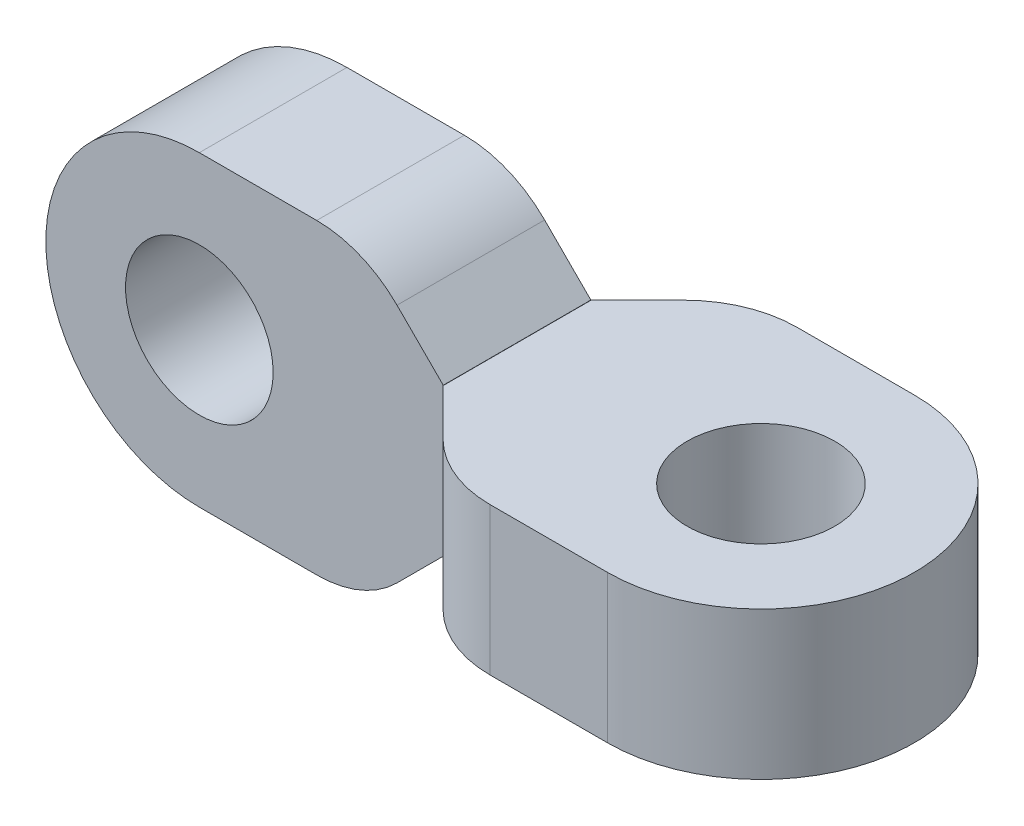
ISO-10303-21;
HEADER;
FILE_DESCRIPTION(('STEP AP214'),'2;1');
FILE_NAME('part.step','',(''),(''),'','','');
FILE_SCHEMA(('AUTOMOTIVE_DESIGN { 1 0 10303 214 1 1 1 1 }'));
ENDSEC;
DATA;
#1=APPLICATION_CONTEXT('core data for automotive mechanical design processes');
#2=APPLICATION_PROTOCOL_DEFINITION('international standard','automotive_design',2000,#1);
#3=PRODUCT_CONTEXT('',#1,'mechanical');
#4=PRODUCT('Part','Part','',(#3));
#5=PRODUCT_RELATED_PRODUCT_CATEGORY('part','',(#4));
#6=PRODUCT_DEFINITION_FORMATION('','',#4);
#7=PRODUCT_DEFINITION_CONTEXT('part definition',#1,'design');
#8=PRODUCT_DEFINITION('design','',#6,#7);
#9=PRODUCT_DEFINITION_SHAPE('','',#8);
#10=(LENGTH_UNIT() NAMED_UNIT(*) SI_UNIT(.MILLI.,.METRE.));
#11=(NAMED_UNIT(*) PLANE_ANGLE_UNIT() SI_UNIT($,.RADIAN.));
#12=(NAMED_UNIT(*) SI_UNIT($,.STERADIAN.) SOLID_ANGLE_UNIT());
#13=UNCERTAINTY_MEASURE_WITH_UNIT(LENGTH_MEASURE(1.E-05),#10,'distance_accuracy_value','');
#14=(GEOMETRIC_REPRESENTATION_CONTEXT(3) GLOBAL_UNCERTAINTY_ASSIGNED_CONTEXT((#13)) GLOBAL_UNIT_ASSIGNED_CONTEXT((#10,
#11,#12)) REPRESENTATION_CONTEXT('',''));
#15=CARTESIAN_POINT('',(0.,0.,0.));
#16=DIRECTION('',(0.,0.,1.));
#17=DIRECTION('',(1.,0.,0.));
#18=AXIS2_PLACEMENT_3D('',#15,#16,#17);
#19=CARTESIAN_POINT('',(13.6398,-8.58519999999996,4.12750000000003));
#20=DIRECTION('',(-1.,0.,0.));
#21=DIRECTION('',(0.,0.,1.));
#22=AXIS2_PLACEMENT_3D('',#19,#20,#21);
#23=PLANE('',#22);
#24=DIRECTION('',(0.,1.,0.));
#25=VECTOR('',#24,1.);
#26=CARTESIAN_POINT('',(13.6398,-8.58519999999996,4.12750000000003));
#27=LINE('',#26,#25);
#28=CARTESIAN_POINT('',(13.6397999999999,-4.14020000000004,4.12750000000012));
#29=VERTEX_POINT('',#28);
#30=CARTESIAN_POINT('',(13.6397999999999,-4.12750000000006,4.12750000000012));
#31=VERTEX_POINT('',#30);
#32=EDGE_CURVE('E235',#29,#31,#27,.T.);
#33=ORIENTED_EDGE('',*,*,#32,.F.);
#34=DIRECTION('',(0.,0.,-1.));
#35=VECTOR('',#34,1.);
#36=CARTESIAN_POINT('',(13.6397999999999,-4.14020000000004,4.12750000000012));
#37=LINE('',#36,#35);
#38=CARTESIAN_POINT('',(13.6398,-4.14020000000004,-4.12750000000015));
#39=VERTEX_POINT('',#38);
#40=EDGE_CURVE('E272',#29,#39,#37,.T.);
#41=ORIENTED_EDGE('',*,*,#40,.T.);
#42=DIRECTION('',(0.,1.,0.));
#43=VECTOR('',#42,1.);
#44=CARTESIAN_POINT('',(13.6398000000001,-8.58519999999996,-4.12749999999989));
#45=LINE('',#44,#43);
#46=CARTESIAN_POINT('',(13.6398,-4.12750000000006,-4.12750000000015));
#47=VERTEX_POINT('',#46);
#48=EDGE_CURVE('E224',#39,#47,#45,.T.);
#49=ORIENTED_EDGE('',*,*,#48,.T.);
#50=DIRECTION('',(0.,0.,-1.));
#51=VECTOR('',#50,1.);
#52=CARTESIAN_POINT('',(13.6398,-4.12749999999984,8.58519999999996));
#53=LINE('',#52,#51);
#54=EDGE_CURVE('E209',#31,#47,#53,.T.);
#55=ORIENTED_EDGE('',*,*,#54,.F.);
#56=EDGE_LOOP('',(#33,#41,#49,#55));
#57=FACE_BOUND('',#56,.T.);
#58=ADVANCED_FACE('F36',(#57),#23,.F.);
#59=CARTESIAN_POINT('',(-1.11022302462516E-13,0.,4.12750000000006));
#60=DIRECTION('',(0.,0.,1.));
#61=DIRECTION('',(1.,0.,0.));
#62=AXIS2_PLACEMENT_3D('',#59,#60,#61);
#63=PLANE('',#62);
#64=DIRECTION('',(0.707106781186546,-0.707106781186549,0.));
#65=VECTOR('',#64,1.);
#66=CARTESIAN_POINT('',(8.89000000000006,8.88999999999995,4.12750000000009));
#67=LINE('',#66,#65);
#68=CARTESIAN_POINT('',(13.6398,4.14019999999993,4.12750000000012));
#69=VERTEX_POINT('',#68);
#70=CARTESIAN_POINT('',(11.0546719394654,6.72532806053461,4.12749999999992));
#71=VERTEX_POINT('',#70);
#72=EDGE_CURVE('E267',#69,#71,#67,.F.);
#73=ORIENTED_EDGE('',*,*,#72,.T.);
#74=CARTESIAN_POINT('',(6.56454387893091,2.23519999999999,4.12750000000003));
#75=DIRECTION('',(0.,0.,1.));
#76=DIRECTION('',(1.,0.,0.));
#77=AXIS2_PLACEMENT_3D('',#74,#75,#76);
#78=CIRCLE('',#77,6.35);
#79=CARTESIAN_POINT('',(6.56454387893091,8.58519999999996,4.12750000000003));
#80=VERTEX_POINT('',#79);
#81=EDGE_CURVE('E296',#71,#80,#78,.T.);
#82=ORIENTED_EDGE('',*,*,#81,.T.);
#83=DIRECTION('',(-1.,0.,0.));
#84=VECTOR('',#83,1.);
#85=CARTESIAN_POINT('',(13.6398,8.58519999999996,4.12750000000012));
#86=LINE('',#85,#84);
#87=CARTESIAN_POINT('',(-1.11022302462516E-13,8.58519999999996,4.12750000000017));
#88=VERTEX_POINT('',#87);
#89=EDGE_CURVE('E237',#80,#88,#86,.T.);
#90=ORIENTED_EDGE('',*,*,#89,.T.);
#91=CARTESIAN_POINT('',(-1.11022302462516E-13,0.,4.12750000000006));
#92=DIRECTION('',(0.,0.,1.));
#93=DIRECTION('',(1.,0.,0.));
#94=AXIS2_PLACEMENT_3D('',#91,#92,#93);
#95=CIRCLE('',#94,8.58519999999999);
#96=CARTESIAN_POINT('',(0.,-8.58519999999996,4.12750000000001));
#97=VERTEX_POINT('',#96);
#98=EDGE_CURVE('E229',#88,#97,#95,.T.);
#99=ORIENTED_EDGE('',*,*,#98,.T.);
#100=DIRECTION('',(1.,0.,0.));
#101=VECTOR('',#100,1.);
#102=CARTESIAN_POINT('',(0.,-8.58519999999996,4.12750000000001));
#103=LINE('',#102,#101);
#104=CARTESIAN_POINT('',(6.56454387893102,-8.58519999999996,4.12749999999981));
#105=VERTEX_POINT('',#104);
#106=EDGE_CURVE('E232',#97,#105,#103,.T.);
#107=ORIENTED_EDGE('',*,*,#106,.T.);
#108=CARTESIAN_POINT('',(6.5645438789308,-2.23519999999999,4.12749999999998));
#109=DIRECTION('',(0.,0.,1.));
#110=DIRECTION('',(1.,0.,0.));
#111=AXIS2_PLACEMENT_3D('',#108,#109,#110);
#112=CIRCLE('',#111,6.35);
#113=CARTESIAN_POINT('',(11.0546719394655,-6.72532806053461,4.12749999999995));
#114=VERTEX_POINT('',#113);
#115=EDGE_CURVE('E51',#105,#114,#112,.T.);
#116=ORIENTED_EDGE('',*,*,#115,.T.);
#117=DIRECTION('',(-0.707106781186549,-0.707106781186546,0.));
#118=VECTOR('',#117,1.);
#119=CARTESIAN_POINT('',(8.88999999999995,-8.88999999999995,4.12749999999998));
#120=LINE('',#119,#118);
#121=EDGE_CURVE('E265',#114,#29,#120,.F.);
#122=ORIENTED_EDGE('',*,*,#121,.T.);
#123=ORIENTED_EDGE('',*,*,#32,.T.);
#124=CARTESIAN_POINT('',(13.6398,4.12749999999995,4.12750000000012));
#125=VERTEX_POINT('',#124);
#126=EDGE_CURVE('E238',#31,#125,#27,.T.);
#127=ORIENTED_EDGE('',*,*,#126,.T.);
#128=EDGE_CURVE('E234',#125,#69,#27,.T.);
#129=ORIENTED_EDGE('',*,*,#128,.T.);
#130=EDGE_LOOP('',(#73,#82,#90,#99,#107,#116,#122,#123,#127,#129));
#131=FACE_BOUND('',#130,.T.);
#132=CARTESIAN_POINT('',(-1.11022302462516E-13,0.,4.12750000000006));
#133=DIRECTION('',(0.,0.,1.));
#134=DIRECTION('',(1.,0.,0.));
#135=AXIS2_PLACEMENT_3D('',#132,#133,#134);
#136=CIRCLE('',#135,4.1275);
#137=CARTESIAN_POINT('',(4.12749999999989,0.,4.12750000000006));
#138=VERTEX_POINT('',#137);
#139=EDGE_CURVE('E214',#138,#138,#136,.T.);
#140=ORIENTED_EDGE('',*,*,#139,.F.);
#141=EDGE_LOOP('',(#140));
#142=FACE_BOUND('',#141,.T.);
#143=ADVANCED_FACE('F305',(#131,#142),#63,.T.);
#144=CARTESIAN_POINT('',(0.,0.,-4.12750000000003));
#145=DIRECTION('',(0.,0.,1.));
#146=DIRECTION('',(1.,0.,0.));
#147=AXIS2_PLACEMENT_3D('',#144,#145,#146);
#148=PLANE('',#147);
#149=DIRECTION('',(-1.,0.,0.));
#150=VECTOR('',#149,1.);
#151=CARTESIAN_POINT('',(13.6398,8.58519999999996,-4.12750000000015));
#152=LINE('',#151,#150);
#153=CARTESIAN_POINT('',(6.56454387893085,8.58519999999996,-4.12749999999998));
#154=VERTEX_POINT('',#153);
#155=CARTESIAN_POINT('',(0.,8.58519999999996,-4.12749999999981));
#156=VERTEX_POINT('',#155);
#157=EDGE_CURVE('E226',#154,#156,#152,.T.);
#158=ORIENTED_EDGE('',*,*,#157,.F.);
#159=CARTESIAN_POINT('',(6.56454387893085,2.23519999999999,-4.12749999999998));
#160=DIRECTION('',(0.,0.,1.));
#161=DIRECTION('',(1.,0.,0.));
#162=AXIS2_PLACEMENT_3D('',#159,#160,#161);
#163=CIRCLE('',#162,6.35);
#164=CARTESIAN_POINT('',(11.0546719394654,6.72532806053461,-4.12749999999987));
#165=VERTEX_POINT('',#164);
#166=EDGE_CURVE('E291',#154,#165,#163,.F.);
#167=ORIENTED_EDGE('',*,*,#166,.T.);
#168=DIRECTION('',(-0.707106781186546,0.707106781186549,0.));
#169=VECTOR('',#168,1.);
#170=CARTESIAN_POINT('',(9.19480000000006,8.58519999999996,-4.12750000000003));
#171=LINE('',#170,#169);
#172=CARTESIAN_POINT('',(13.6398,4.14019999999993,-4.12750000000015));
#173=VERTEX_POINT('',#172);
#174=EDGE_CURVE('E261',#165,#173,#171,.F.);
#175=ORIENTED_EDGE('',*,*,#174,.T.);
#176=CARTESIAN_POINT('',(13.6398,4.12749999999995,-4.12750000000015));
#177=VERTEX_POINT('',#176);
#178=EDGE_CURVE('E223',#177,#173,#45,.T.);
#179=ORIENTED_EDGE('',*,*,#178,.F.);
#180=EDGE_CURVE('E227',#47,#177,#45,.T.);
#181=ORIENTED_EDGE('',*,*,#180,.F.);
#182=ORIENTED_EDGE('',*,*,#48,.F.);
#183=DIRECTION('',(0.707106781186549,0.707106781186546,0.));
#184=VECTOR('',#183,1.);
#185=CARTESIAN_POINT('',(13.6398,-4.14020000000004,-4.12750000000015));
#186=LINE('',#185,#184);
#187=CARTESIAN_POINT('',(11.0546719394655,-6.72532806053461,-4.12749999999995));
#188=VERTEX_POINT('',#187);
#189=EDGE_CURVE('E258',#39,#188,#186,.F.);
#190=ORIENTED_EDGE('',*,*,#189,.T.);
#191=CARTESIAN_POINT('',(6.56454387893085,-2.23519999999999,-4.12749999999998));
#192=DIRECTION('',(0.,0.,1.));
#193=DIRECTION('',(1.,0.,0.));
#194=AXIS2_PLACEMENT_3D('',#191,#192,#193);
#195=CIRCLE('',#194,6.35);
#196=CARTESIAN_POINT('',(6.56454387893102,-8.58519999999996,-4.12750000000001));
#197=VERTEX_POINT('',#196);
#198=EDGE_CURVE('E289',#188,#197,#195,.F.);
#199=ORIENTED_EDGE('',*,*,#198,.T.);
#200=DIRECTION('',(1.,0.,0.));
#201=VECTOR('',#200,1.);
#202=CARTESIAN_POINT('',(2.22044604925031E-13,-8.58519999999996,-4.12750000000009));
#203=LINE('',#202,#201);
#204=CARTESIAN_POINT('',(2.22044604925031E-13,-8.58519999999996,-4.12750000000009));
#205=VERTEX_POINT('',#204);
#206=EDGE_CURVE('E220',#205,#197,#203,.T.);
#207=ORIENTED_EDGE('',*,*,#206,.F.);
#208=CARTESIAN_POINT('',(0.,0.,-4.12750000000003));
#209=DIRECTION('',(0.,0.,1.));
#210=DIRECTION('',(1.,0.,0.));
#211=AXIS2_PLACEMENT_3D('',#208,#209,#210);
#212=CIRCLE('',#211,8.58519999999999);
#213=EDGE_CURVE('E217',#156,#205,#212,.T.);
#214=ORIENTED_EDGE('',*,*,#213,.F.);
#215=EDGE_LOOP('',(#158,#167,#175,#179,#181,#182,#190,#199,#207,#214));
#216=FACE_BOUND('',#215,.T.);
#217=CARTESIAN_POINT('',(0.,0.,-4.12750000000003));
#218=DIRECTION('',(0.,0.,1.));
#219=DIRECTION('',(1.,0.,0.));
#220=AXIS2_PLACEMENT_3D('',#217,#218,#219);
#221=CIRCLE('',#220,4.1275);
#222=CARTESIAN_POINT('',(4.1275,0.,-4.12750000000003));
#223=VERTEX_POINT('',#222);
#224=EDGE_CURVE('E183',#223,#223,#221,.T.);
#225=ORIENTED_EDGE('',*,*,#224,.T.);
#226=EDGE_LOOP('',(#225));
#227=FACE_BOUND('',#226,.T.);
#228=ADVANCED_FACE('F315',(#216,#227),#148,.F.);
#229=CARTESIAN_POINT('',(-1.11022302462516E-13,0.,4.12750000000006));
#230=DIRECTION('',(0.,0.,-1.));
#231=DIRECTION('',(-1.,0.,0.));
#232=AXIS2_PLACEMENT_3D('',#229,#230,#231);
#233=CYLINDRICAL_SURFACE('',#232,8.58519999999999);
#234=ORIENTED_EDGE('',*,*,#213,.T.);
#235=DIRECTION('',(0.,0.,-1.));
#236=VECTOR('',#235,1.);
#237=CARTESIAN_POINT('',(0.,-8.58519999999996,4.12750000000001));
#238=LINE('',#237,#236);
#239=EDGE_CURVE('E243',#97,#205,#238,.T.);
#240=ORIENTED_EDGE('',*,*,#239,.F.);
#241=ORIENTED_EDGE('',*,*,#98,.F.);
#242=DIRECTION('',(0.,0.,-1.));
#243=VECTOR('',#242,1.);
#244=CARTESIAN_POINT('',(-1.11022302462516E-13,8.58519999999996,4.12750000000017));
#245=LINE('',#244,#243);
#246=EDGE_CURVE('E240',#88,#156,#245,.T.);
#247=ORIENTED_EDGE('',*,*,#246,.T.);
#248=EDGE_LOOP('',(#234,#240,#241,#247));
#249=FACE_BOUND('',#248,.T.);
#250=ADVANCED_FACE('F38',(#249),#233,.T.);
#251=CARTESIAN_POINT('',(0.,-8.58519999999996,4.12750000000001));
#252=DIRECTION('',(0.,1.,0.));
#253=DIRECTION('',(0.,0.,1.));
#254=AXIS2_PLACEMENT_3D('',#251,#252,#253);
#255=PLANE('',#254);
#256=ORIENTED_EDGE('',*,*,#206,.T.);
#257=DIRECTION('',(0.,0.,-1.));
#258=VECTOR('',#257,1.);
#259=CARTESIAN_POINT('',(6.56454387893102,-8.58519999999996,4.12749999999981));
#260=LINE('',#259,#258);
#261=EDGE_CURVE('E44',#197,#105,#260,.F.);
#262=ORIENTED_EDGE('',*,*,#261,.T.);
#263=ORIENTED_EDGE('',*,*,#106,.F.);
#264=ORIENTED_EDGE('',*,*,#239,.T.);
#265=EDGE_LOOP('',(#256,#262,#263,#264));
#266=FACE_BOUND('',#265,.T.);
#267=ADVANCED_FACE('F303',(#266),#255,.F.);
#268=ORIENTED_EDGE('',*,*,#178,.T.);
#269=DIRECTION('',(0.,0.,1.));
#270=VECTOR('',#269,1.);
#271=CARTESIAN_POINT('',(13.6398,4.14019999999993,4.12750000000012));
#272=LINE('',#271,#270);
#273=EDGE_CURVE('E263',#173,#69,#272,.T.);
#274=ORIENTED_EDGE('',*,*,#273,.T.);
#275=ORIENTED_EDGE('',*,*,#128,.F.);
#276=DIRECTION('',(0.,0.,-1.));
#277=VECTOR('',#276,1.);
#278=CARTESIAN_POINT('',(13.6397999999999,4.12750000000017,8.58520000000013));
#279=LINE('',#278,#277);
#280=EDGE_CURVE('E199',#125,#177,#279,.T.);
#281=ORIENTED_EDGE('',*,*,#280,.T.);
#282=EDGE_LOOP('',(#268,#274,#275,#281));
#283=FACE_BOUND('',#282,.T.);
#284=ADVANCED_FACE('F354',(#283),#23,.F.);
#285=CARTESIAN_POINT('',(13.6398,8.58519999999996,4.12750000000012));
#286=DIRECTION('',(0.,-1.,0.));
#287=DIRECTION('',(1.,0.,0.));
#288=AXIS2_PLACEMENT_3D('',#285,#286,#287);
#289=PLANE('',#288);
#290=ORIENTED_EDGE('',*,*,#89,.F.);
#291=DIRECTION('',(0.,0.,1.));
#292=VECTOR('',#291,1.);
#293=CARTESIAN_POINT('',(6.56454387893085,8.58519999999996,-4.12749999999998));
#294=LINE('',#293,#292);
#295=EDGE_CURVE('E286',#80,#154,#294,.F.);
#296=ORIENTED_EDGE('',*,*,#295,.T.);
#297=ORIENTED_EDGE('',*,*,#157,.T.);
#298=ORIENTED_EDGE('',*,*,#246,.F.);
#299=EDGE_LOOP('',(#290,#296,#297,#298));
#300=FACE_BOUND('',#299,.T.);
#301=ADVANCED_FACE('F351',(#300),#289,.F.);
#302=CARTESIAN_POINT('',(-1.11022302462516E-13,0.,4.12750000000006));
#303=DIRECTION('',(0.,0.,-1.));
#304=DIRECTION('',(-1.,0.,0.));
#305=AXIS2_PLACEMENT_3D('',#302,#303,#304);
#306=CYLINDRICAL_SURFACE('',#305,4.1275);
#307=ORIENTED_EDGE('',*,*,#139,.T.);
#308=EDGE_LOOP('',(#307));
#309=FACE_BOUND('',#308,.T.);
#310=ORIENTED_EDGE('',*,*,#224,.F.);
#311=EDGE_LOOP('',(#310));
#312=FACE_BOUND('',#311,.T.);
#313=ADVANCED_FACE('F353',(#309,#312),#306,.F.);
#314=CARTESIAN_POINT('',(13.6398,-4.12749999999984,8.58519999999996));
#315=DIRECTION('',(1.,0.,0.));
#316=DIRECTION('',(0.,0.,-1.));
#317=AXIS2_PLACEMENT_3D('',#314,#315,#316);
#318=PLANE('',#317);
#319=CARTESIAN_POINT('',(13.6398000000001,4.12749999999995,-4.14019999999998));
#320=VERTEX_POINT('',#319);
#321=EDGE_CURVE('E173',#177,#320,#279,.T.);
#322=ORIENTED_EDGE('',*,*,#321,.T.);
#323=DIRECTION('',(0.,-1.,0.));
#324=VECTOR('',#323,1.);
#325=CARTESIAN_POINT('',(13.6397999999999,-4.12750000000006,-4.14020000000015));
#326=LINE('',#325,#324);
#327=CARTESIAN_POINT('',(13.6397999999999,-4.12750000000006,-4.14020000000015));
#328=VERTEX_POINT('',#327);
#329=EDGE_CURVE('E270',#320,#328,#326,.T.);
#330=ORIENTED_EDGE('',*,*,#329,.T.);
#331=EDGE_CURVE('E204',#47,#328,#53,.T.);
#332=ORIENTED_EDGE('',*,*,#331,.F.);
#333=ORIENTED_EDGE('',*,*,#180,.T.);
#334=EDGE_LOOP('',(#322,#330,#332,#333));
#335=FACE_BOUND('',#334,.T.);
#336=ADVANCED_FACE('F360',(#335),#318,.F.);
#337=CARTESIAN_POINT('',(27.2796,-4.12749999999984,0.));
#338=DIRECTION('',(0.,-1.,0.));
#339=DIRECTION('',(0.,0.,-1.));
#340=AXIS2_PLACEMENT_3D('',#337,#338,#339);
#341=PLANE('',#340);
#342=DIRECTION('',(-1.,0.,0.));
#343=VECTOR('',#342,1.);
#344=CARTESIAN_POINT('',(27.2796000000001,-4.12749999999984,8.58520000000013));
#345=LINE('',#344,#343);
#346=CARTESIAN_POINT('',(27.2796000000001,-4.12749999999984,8.58520000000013));
#347=VERTEX_POINT('',#346);
#348=CARTESIAN_POINT('',(20.7150561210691,-4.12749999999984,8.58520000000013));
#349=VERTEX_POINT('',#348);
#350=EDGE_CURVE('E179',#347,#349,#345,.T.);
#351=ORIENTED_EDGE('',*,*,#350,.T.);
#352=CARTESIAN_POINT('',(20.7150561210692,-4.12749999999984,2.23520000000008));
#353=DIRECTION('',(0.,-1.,0.));
#354=DIRECTION('',(0.,0.,-1.));
#355=AXIS2_PLACEMENT_3D('',#352,#353,#354);
#356=CIRCLE('',#355,6.35);
#357=CARTESIAN_POINT('',(16.2249280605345,-4.12749999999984,6.72532806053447));
#358=VERTEX_POINT('',#357);
#359=EDGE_CURVE('E279',#349,#358,#356,.T.);
#360=ORIENTED_EDGE('',*,*,#359,.T.);
#361=DIRECTION('',(0.707106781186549,0.,0.707106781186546));
#362=VECTOR('',#361,1.);
#363=CARTESIAN_POINT('',(18.3895999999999,-4.12749999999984,8.88999999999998));
#364=LINE('',#363,#362);
#365=CARTESIAN_POINT('',(13.6397999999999,-4.12750000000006,4.14020000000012));
#366=VERTEX_POINT('',#365);
#367=EDGE_CURVE('E256',#358,#366,#364,.F.);
#368=ORIENTED_EDGE('',*,*,#367,.T.);
#369=EDGE_CURVE('E205',#366,#31,#53,.T.);
#370=ORIENTED_EDGE('',*,*,#369,.T.);
#371=ORIENTED_EDGE('',*,*,#54,.T.);
#372=ORIENTED_EDGE('',*,*,#331,.T.);
#373=DIRECTION('',(-0.707106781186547,0.,0.707106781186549));
#374=VECTOR('',#373,1.);
#375=CARTESIAN_POINT('',(18.3896,-4.12750000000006,-8.88999999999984));
#376=LINE('',#375,#374);
#377=CARTESIAN_POINT('',(16.2249280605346,-4.12750000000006,-6.7253280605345));
#378=VERTEX_POINT('',#377);
#379=EDGE_CURVE('E253',#328,#378,#376,.F.);
#380=ORIENTED_EDGE('',*,*,#379,.T.);
#381=CARTESIAN_POINT('',(20.7150561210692,-4.12750000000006,-2.23519999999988));
#382=DIRECTION('',(0.,-1.,0.));
#383=DIRECTION('',(0.,0.,-1.));
#384=AXIS2_PLACEMENT_3D('',#381,#382,#383);
#385=CIRCLE('',#384,6.35);
#386=CARTESIAN_POINT('',(20.7150561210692,-4.12750000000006,-8.58519999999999));
#387=VERTEX_POINT('',#386);
#388=EDGE_CURVE('E277',#378,#387,#385,.T.);
#389=ORIENTED_EDGE('',*,*,#388,.T.);
#390=DIRECTION('',(1.,0.,0.));
#391=VECTOR('',#390,1.);
#392=CARTESIAN_POINT('',(13.6398,-4.12750000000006,-8.58520000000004));
#393=LINE('',#392,#391);
#394=CARTESIAN_POINT('',(27.2796,-4.12749999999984,-8.58520000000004));
#395=VERTEX_POINT('',#394);
#396=EDGE_CURVE('E208',#387,#395,#393,.T.);
#397=ORIENTED_EDGE('',*,*,#396,.T.);
#398=CARTESIAN_POINT('',(27.2796,-4.12749999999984,0.));
#399=DIRECTION('',(0.,-1.,0.));
#400=DIRECTION('',(0.,0.,-1.));
#401=AXIS2_PLACEMENT_3D('',#398,#399,#400);
#402=CIRCLE('',#401,8.58519999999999);
#403=EDGE_CURVE('E201',#395,#347,#402,.T.);
#404=ORIENTED_EDGE('',*,*,#403,.T.);
#405=EDGE_LOOP('',(#351,#360,#368,#370,#371,#372,#380,#389,#397,#404));
#406=FACE_BOUND('',#405,.T.);
#407=CARTESIAN_POINT('',(27.2796,-4.12749999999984,0.));
#408=DIRECTION('',(0.,-1.,0.));
#409=DIRECTION('',(0.,0.,-1.));
#410=AXIS2_PLACEMENT_3D('',#407,#408,#409);
#411=CIRCLE('',#410,4.1275);
#412=CARTESIAN_POINT('',(27.2796,-4.12749999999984,-4.12749999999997));
#413=VERTEX_POINT('',#412);
#414=EDGE_CURVE('E189',#413,#413,#411,.T.);
#415=ORIENTED_EDGE('',*,*,#414,.F.);
#416=EDGE_LOOP('',(#415));
#417=FACE_BOUND('',#416,.T.);
#418=ADVANCED_FACE('F391',(#406,#417),#341,.T.);
#419=CARTESIAN_POINT('',(27.2796,4.12750000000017,0.));
#420=DIRECTION('',(0.,-1.,0.));
#421=DIRECTION('',(0.,0.,-1.));
#422=AXIS2_PLACEMENT_3D('',#419,#420,#421);
#423=PLANE('',#422);
#424=DIRECTION('',(-0.707106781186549,0.,-0.707106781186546));
#425=VECTOR('',#424,1.);
#426=CARTESIAN_POINT('',(13.6398,4.12749999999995,4.14020000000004));
#427=LINE('',#426,#425);
#428=CARTESIAN_POINT('',(13.6398,4.12749999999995,4.14020000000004));
#429=VERTEX_POINT('',#428);
#430=CARTESIAN_POINT('',(16.2249280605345,4.12750000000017,6.72532806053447));
#431=VERTEX_POINT('',#430);
#432=EDGE_CURVE('E251',#429,#431,#427,.F.);
#433=ORIENTED_EDGE('',*,*,#432,.T.);
#434=CARTESIAN_POINT('',(20.7150561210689,4.12750000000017,2.23520000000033));
#435=DIRECTION('',(0.,-1.,0.));
#436=DIRECTION('',(0.,0.,-1.));
#437=AXIS2_PLACEMENT_3D('',#434,#435,#436);
#438=CIRCLE('',#437,6.35);
#439=CARTESIAN_POINT('',(20.7150561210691,4.12750000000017,8.58520000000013));
#440=VERTEX_POINT('',#439);
#441=EDGE_CURVE('E169',#431,#440,#438,.F.);
#442=ORIENTED_EDGE('',*,*,#441,.T.);
#443=DIRECTION('',(-1.,0.,0.));
#444=VECTOR('',#443,1.);
#445=CARTESIAN_POINT('',(27.2796000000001,4.12750000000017,8.58520000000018));
#446=LINE('',#445,#444);
#447=CARTESIAN_POINT('',(27.2796000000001,4.12750000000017,8.58520000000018));
#448=VERTEX_POINT('',#447);
#449=EDGE_CURVE('E160',#448,#440,#446,.T.);
#450=ORIENTED_EDGE('',*,*,#449,.F.);
#451=CARTESIAN_POINT('',(27.2796,4.12750000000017,0.));
#452=DIRECTION('',(0.,-1.,0.));
#453=DIRECTION('',(0.,0.,-1.));
#454=AXIS2_PLACEMENT_3D('',#451,#452,#453);
#455=CIRCLE('',#454,8.58519999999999);
#456=CARTESIAN_POINT('',(27.2796,4.12750000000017,-8.58520000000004));
#457=VERTEX_POINT('',#456);
#458=EDGE_CURVE('E167',#457,#448,#455,.T.);
#459=ORIENTED_EDGE('',*,*,#458,.F.);
#460=DIRECTION('',(1.,0.,0.));
#461=VECTOR('',#460,1.);
#462=CARTESIAN_POINT('',(13.6398000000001,4.12749999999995,-8.58519999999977));
#463=LINE('',#462,#461);
#464=CARTESIAN_POINT('',(20.7150561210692,4.12749999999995,-8.58519999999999));
#465=VERTEX_POINT('',#464);
#466=EDGE_CURVE('E198',#465,#457,#463,.T.);
#467=ORIENTED_EDGE('',*,*,#466,.F.);
#468=CARTESIAN_POINT('',(20.7150561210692,4.12749999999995,-2.23519999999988));
#469=DIRECTION('',(0.,-1.,0.));
#470=DIRECTION('',(0.,0.,-1.));
#471=AXIS2_PLACEMENT_3D('',#468,#469,#470);
#472=CIRCLE('',#471,6.35);
#473=CARTESIAN_POINT('',(16.2249280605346,4.12749999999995,-6.7253280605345));
#474=VERTEX_POINT('',#473);
#475=EDGE_CURVE('E283',#465,#474,#472,.F.);
#476=ORIENTED_EDGE('',*,*,#475,.T.);
#477=DIRECTION('',(0.707106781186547,0.,-0.707106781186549));
#478=VECTOR('',#477,1.);
#479=CARTESIAN_POINT('',(18.0848,4.12749999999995,-8.58519999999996));
#480=LINE('',#479,#478);
#481=EDGE_CURVE('E249',#474,#320,#480,.F.);
#482=ORIENTED_EDGE('',*,*,#481,.T.);
#483=ORIENTED_EDGE('',*,*,#321,.F.);
#484=ORIENTED_EDGE('',*,*,#280,.F.);
#485=EDGE_CURVE('E196',#429,#125,#279,.T.);
#486=ORIENTED_EDGE('',*,*,#485,.F.);
#487=EDGE_LOOP('',(#433,#442,#450,#459,#467,#476,#482,#483,#484,#486));
#488=FACE_BOUND('',#487,.T.);
#489=CARTESIAN_POINT('',(27.2796,4.12750000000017,0.));
#490=DIRECTION('',(0.,-1.,0.));
#491=DIRECTION('',(0.,0.,-1.));
#492=AXIS2_PLACEMENT_3D('',#489,#490,#491);
#493=CIRCLE('',#492,4.1275);
#494=CARTESIAN_POINT('',(27.2796,4.12750000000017,-4.12749999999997));
#495=VERTEX_POINT('',#494);
#496=EDGE_CURVE('E192',#495,#495,#493,.T.);
#497=ORIENTED_EDGE('',*,*,#496,.T.);
#498=EDGE_LOOP('',(#497));
#499=FACE_BOUND('',#498,.T.);
#500=ADVANCED_FACE('F163',(#488,#499),#423,.F.);
#501=CARTESIAN_POINT('',(27.2796,-4.12749999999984,0.));
#502=DIRECTION('',(0.,1.,0.));
#503=DIRECTION('',(0.,0.,1.));
#504=AXIS2_PLACEMENT_3D('',#501,#502,#503);
#505=CYLINDRICAL_SURFACE('',#504,8.58519999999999);
#506=ORIENTED_EDGE('',*,*,#458,.T.);
#507=DIRECTION('',(0.,1.,0.));
#508=VECTOR('',#507,1.);
#509=CARTESIAN_POINT('',(27.2796000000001,-4.12749999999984,8.58520000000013));
#510=LINE('',#509,#508);
#511=EDGE_CURVE('E176',#347,#448,#510,.T.);
#512=ORIENTED_EDGE('',*,*,#511,.F.);
#513=ORIENTED_EDGE('',*,*,#403,.F.);
#514=DIRECTION('',(0.,1.,0.));
#515=VECTOR('',#514,1.);
#516=CARTESIAN_POINT('',(27.2796,-4.12749999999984,-8.58520000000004));
#517=LINE('',#516,#515);
#518=EDGE_CURVE('E184',#395,#457,#517,.T.);
#519=ORIENTED_EDGE('',*,*,#518,.T.);
#520=EDGE_LOOP('',(#506,#512,#513,#519));
#521=FACE_BOUND('',#520,.T.);
#522=ADVANCED_FACE('F187',(#521),#505,.T.);
#523=CARTESIAN_POINT('',(27.2796000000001,-4.12749999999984,8.58520000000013));
#524=DIRECTION('',(0.,0.,-1.));
#525=DIRECTION('',(-1.,0.,0.));
#526=AXIS2_PLACEMENT_3D('',#523,#524,#525);
#527=PLANE('',#526);
#528=ORIENTED_EDGE('',*,*,#449,.T.);
#529=DIRECTION('',(0.,1.,0.));
#530=VECTOR('',#529,1.);
#531=CARTESIAN_POINT('',(20.7150561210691,-4.12749999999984,8.58520000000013));
#532=LINE('',#531,#530);
#533=EDGE_CURVE('E275',#440,#349,#532,.F.);
#534=ORIENTED_EDGE('',*,*,#533,.T.);
#535=ORIENTED_EDGE('',*,*,#350,.F.);
#536=ORIENTED_EDGE('',*,*,#511,.T.);
#537=EDGE_LOOP('',(#528,#534,#535,#536));
#538=FACE_BOUND('',#537,.T.);
#539=ADVANCED_FACE('F177',(#538),#527,.F.);
#540=ORIENTED_EDGE('',*,*,#369,.F.);
#541=DIRECTION('',(0.,1.,0.));
#542=VECTOR('',#541,1.);
#543=CARTESIAN_POINT('',(13.6398,-4.12750000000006,4.14020000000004));
#544=LINE('',#543,#542);
#545=EDGE_CURVE('E246',#366,#429,#544,.T.);
#546=ORIENTED_EDGE('',*,*,#545,.T.);
#547=ORIENTED_EDGE('',*,*,#485,.T.);
#548=ORIENTED_EDGE('',*,*,#126,.F.);
#549=EDGE_LOOP('',(#540,#546,#547,#548));
#550=FACE_BOUND('',#549,.T.);
#551=ADVANCED_FACE('F333',(#550),#318,.F.);
#552=CARTESIAN_POINT('',(13.6398,-4.12750000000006,-8.58520000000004));
#553=DIRECTION('',(0.,0.,1.));
#554=DIRECTION('',(1.,0.,0.));
#555=AXIS2_PLACEMENT_3D('',#552,#553,#554);
#556=PLANE('',#555);
#557=ORIENTED_EDGE('',*,*,#396,.F.);
#558=DIRECTION('',(0.,-1.,0.));
#559=VECTOR('',#558,1.);
#560=CARTESIAN_POINT('',(20.7150561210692,4.12749999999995,-8.58519999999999));
#561=LINE('',#560,#559);
#562=EDGE_CURVE('E298',#387,#465,#561,.F.);
#563=ORIENTED_EDGE('',*,*,#562,.T.);
#564=ORIENTED_EDGE('',*,*,#466,.T.);
#565=ORIENTED_EDGE('',*,*,#518,.F.);
#566=EDGE_LOOP('',(#557,#563,#564,#565));
#567=FACE_BOUND('',#566,.T.);
#568=ADVANCED_FACE('F386',(#567),#556,.F.);
#569=CARTESIAN_POINT('',(27.2796,-4.12749999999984,0.));
#570=DIRECTION('',(0.,1.,0.));
#571=DIRECTION('',(0.,0.,1.));
#572=AXIS2_PLACEMENT_3D('',#569,#570,#571);
#573=CYLINDRICAL_SURFACE('',#572,4.1275);
#574=ORIENTED_EDGE('',*,*,#414,.T.);
#575=EDGE_LOOP('',(#574));
#576=FACE_BOUND('',#575,.T.);
#577=ORIENTED_EDGE('',*,*,#496,.F.);
#578=EDGE_LOOP('',(#577));
#579=FACE_BOUND('',#578,.T.);
#580=ADVANCED_FACE('F389',(#576,#579),#573,.F.);
#581=CARTESIAN_POINT('',(13.6398,-4.12750000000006,4.14020000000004));
#582=DIRECTION('',(0.707106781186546,0.,-0.707106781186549));
#583=DIRECTION('',(-0.707106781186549,0.,-0.707106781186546));
#584=AXIS2_PLACEMENT_3D('',#581,#582,#583);
#585=PLANE('',#584);
#586=ORIENTED_EDGE('',*,*,#367,.F.);
#587=DIRECTION('',(0.,-1.,0.));
#588=VECTOR('',#587,1.);
#589=CARTESIAN_POINT('',(16.2249280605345,4.12750000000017,6.72532806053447));
#590=LINE('',#589,#588);
#591=EDGE_CURVE('E281',#358,#431,#590,.F.);
#592=ORIENTED_EDGE('',*,*,#591,.T.);
#593=ORIENTED_EDGE('',*,*,#432,.F.);
#594=ORIENTED_EDGE('',*,*,#545,.F.);
#595=EDGE_LOOP('',(#586,#592,#593,#594));
#596=FACE_BOUND('',#595,.T.);
#597=ADVANCED_FACE('F398',(#596),#585,.F.);
#598=CARTESIAN_POINT('',(9.1948,8.58519999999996,4.12749999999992));
#599=DIRECTION('',(-0.707106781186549,-0.707106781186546,0.));
#600=DIRECTION('',(0.707106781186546,-0.707106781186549,0.));
#601=AXIS2_PLACEMENT_3D('',#598,#599,#600);
#602=PLANE('',#601);
#603=ORIENTED_EDGE('',*,*,#174,.F.);
#604=DIRECTION('',(0.,0.,-1.));
#605=VECTOR('',#604,1.);
#606=CARTESIAN_POINT('',(11.0546719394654,6.72532806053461,4.12749999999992));
#607=LINE('',#606,#605);
#608=EDGE_CURVE('E293',#165,#71,#607,.F.);
#609=ORIENTED_EDGE('',*,*,#608,.T.);
#610=ORIENTED_EDGE('',*,*,#72,.F.);
#611=ORIENTED_EDGE('',*,*,#273,.F.);
#612=EDGE_LOOP('',(#603,#609,#610,#611));
#613=FACE_BOUND('',#612,.T.);
#614=ADVANCED_FACE('F345',(#613),#602,.F.);
#615=CARTESIAN_POINT('',(18.0848,-4.12750000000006,-8.58519999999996));
#616=DIRECTION('',(0.707106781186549,0.,0.707106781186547));
#617=DIRECTION('',(0.707106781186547,0.,-0.707106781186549));
#618=AXIS2_PLACEMENT_3D('',#615,#616,#617);
#619=PLANE('',#618);
#620=ORIENTED_EDGE('',*,*,#481,.F.);
#621=DIRECTION('',(0.,1.,0.));
#622=VECTOR('',#621,1.);
#623=CARTESIAN_POINT('',(16.2249280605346,-4.12750000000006,-6.7253280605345));
#624=LINE('',#623,#622);
#625=EDGE_CURVE('E301',#474,#378,#624,.F.);
#626=ORIENTED_EDGE('',*,*,#625,.T.);
#627=ORIENTED_EDGE('',*,*,#379,.F.);
#628=ORIENTED_EDGE('',*,*,#329,.F.);
#629=EDGE_LOOP('',(#620,#626,#627,#628));
#630=FACE_BOUND('',#629,.T.);
#631=ADVANCED_FACE('F405',(#630),#619,.F.);
#632=CARTESIAN_POINT('',(13.6397999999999,-4.14020000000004,4.12750000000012));
#633=DIRECTION('',(-0.707106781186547,0.707106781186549,0.));
#634=DIRECTION('',(-0.707106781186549,-0.707106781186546,0.));
#635=AXIS2_PLACEMENT_3D('',#632,#633,#634);
#636=PLANE('',#635);
#637=ORIENTED_EDGE('',*,*,#121,.F.);
#638=DIRECTION('',(0.,0.,1.));
#639=VECTOR('',#638,1.);
#640=CARTESIAN_POINT('',(11.0546719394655,-6.72532806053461,-4.12749999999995));
#641=LINE('',#640,#639);
#642=EDGE_CURVE('E11',#114,#188,#641,.F.);
#643=ORIENTED_EDGE('',*,*,#642,.T.);
#644=ORIENTED_EDGE('',*,*,#189,.F.);
#645=ORIENTED_EDGE('',*,*,#40,.F.);
#646=EDGE_LOOP('',(#637,#643,#644,#645));
#647=FACE_BOUND('',#646,.T.);
#648=ADVANCED_FACE('F320',(#647),#636,.F.);
#649=CARTESIAN_POINT('',(20.7150561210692,-4.12749999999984,2.23520000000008));
#650=DIRECTION('',(0.,-1.,0.));
#651=DIRECTION('',(0.,0.,-1.));
#652=AXIS2_PLACEMENT_3D('',#649,#650,#651);
#653=CYLINDRICAL_SURFACE('',#652,6.35);
#654=ORIENTED_EDGE('',*,*,#441,.F.);
#655=ORIENTED_EDGE('',*,*,#591,.F.);
#656=ORIENTED_EDGE('',*,*,#359,.F.);
#657=ORIENTED_EDGE('',*,*,#533,.F.);
#658=EDGE_LOOP('',(#654,#655,#656,#657));
#659=FACE_BOUND('',#658,.T.);
#660=ADVANCED_FACE('F411',(#659),#653,.T.);
#661=CARTESIAN_POINT('',(6.56454387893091,2.23519999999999,4.12750000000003));
#662=DIRECTION('',(0.,0.,-1.));
#663=DIRECTION('',(-1.,0.,0.));
#664=AXIS2_PLACEMENT_3D('',#661,#662,#663);
#665=CYLINDRICAL_SURFACE('',#664,6.35);
#666=ORIENTED_EDGE('',*,*,#81,.F.);
#667=ORIENTED_EDGE('',*,*,#608,.F.);
#668=ORIENTED_EDGE('',*,*,#166,.F.);
#669=ORIENTED_EDGE('',*,*,#295,.F.);
#670=EDGE_LOOP('',(#666,#667,#668,#669));
#671=FACE_BOUND('',#670,.T.);
#672=ADVANCED_FACE('F348',(#671),#665,.T.);
#673=CARTESIAN_POINT('',(20.7150561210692,-4.12750000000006,-2.23519999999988));
#674=DIRECTION('',(0.,1.,0.));
#675=DIRECTION('',(0.,0.,1.));
#676=AXIS2_PLACEMENT_3D('',#673,#674,#675);
#677=CYLINDRICAL_SURFACE('',#676,6.35);
#678=ORIENTED_EDGE('',*,*,#388,.F.);
#679=ORIENTED_EDGE('',*,*,#625,.F.);
#680=ORIENTED_EDGE('',*,*,#475,.F.);
#681=ORIENTED_EDGE('',*,*,#562,.F.);
#682=EDGE_LOOP('',(#678,#679,#680,#681));
#683=FACE_BOUND('',#682,.T.);
#684=ADVANCED_FACE('F417',(#683),#677,.T.);
#685=CARTESIAN_POINT('',(6.5645438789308,-2.23519999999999,4.12749999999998));
#686=DIRECTION('',(0.,0.,1.));
#687=DIRECTION('',(1.,0.,0.));
#688=AXIS2_PLACEMENT_3D('',#685,#686,#687);
#689=CYLINDRICAL_SURFACE('',#688,6.35);
#690=ORIENTED_EDGE('',*,*,#198,.F.);
#691=ORIENTED_EDGE('',*,*,#642,.F.);
#692=ORIENTED_EDGE('',*,*,#115,.F.);
#693=ORIENTED_EDGE('',*,*,#261,.F.);
#694=EDGE_LOOP('',(#690,#691,#692,#693));
#695=FACE_BOUND('',#694,.T.);
#696=ADVANCED_FACE('F318',(#695),#689,.T.);
#697=CLOSED_SHELL('',(#58,#143,#228,#250,#267,#284,#301,#313,#336,#418,#500,#522,#539,#551,#568,
#580,#597,#614,#631,#648,#660,#672,#684,#696));
#698=MANIFOLD_SOLID_BREP('B2',#697);
#699=ADVANCED_BREP_SHAPE_REPRESENTATION('',(#18,#698),#14);
#700=SHAPE_DEFINITION_REPRESENTATION(#9,#699);
ENDSEC;
END-ISO-10303-21;
